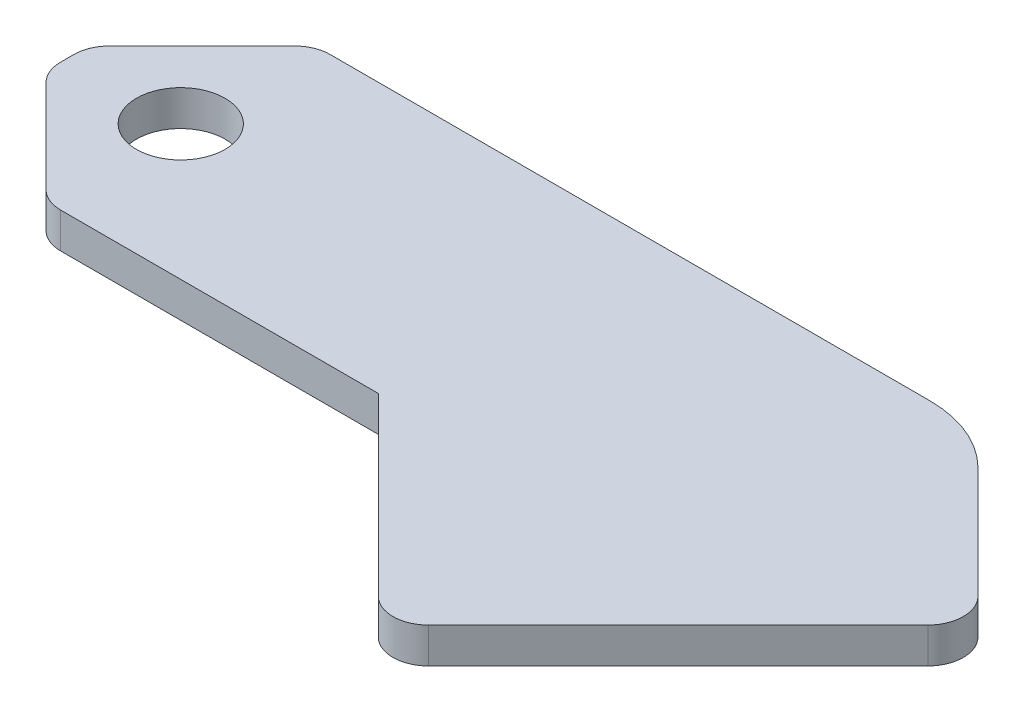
from build123d import *

# Parameters (mm, degrees)
ESQUISSE1_R        = 6.25
BOSS_EXTRU_1_DEPTH = 5


with BuildPart() as part:
    # Esquisse1 → Boss.-Extru.1 (new body)
    with BuildSketch(Plane(origin=(0, 2.5, 0), x_dir=(1, 0, 0), z_dir=(0, 1, 0))):
        with BuildLine():
            Line((-14.535533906, -4.464466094), (-1.464466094, -17.535533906))
            ThreePointArc((-1.464466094, -17.535533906), (0.15765065, -18.619397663), (2.071067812, -19))
            Line((2.071067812, -19), (46.852813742, -19))
            Line((46.852813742, -19), (71.601551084, -43.748737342))
            ThreePointArc((71.601551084, -43.748737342), (75.13708499, -45.213203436), (78.672618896, -43.748737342))
            Line((78.672618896, -43.748737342), (113.886536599, -8.534819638))
            ThreePointArc((113.886536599, -8.534819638), (115.351002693, -4.999285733), (113.886536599, -1.463751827))
            Line((113.886536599, -1.463751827), (98.214517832, 14.20826694))
            ThreePointArc((98.214517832, 14.20826694), (92.906951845, 17.754669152), (86.646250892, 19))
            Line((86.646250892, 19), (2.071067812, 19))
            ThreePointArc((2.071067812, 19), (0.15765065, 18.619397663), (-1.464466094, 17.535533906))
            Line((-1.464466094, 17.535533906), (-14.535533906, 4.464466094))
            ThreePointArc((-14.535533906, 4.464466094), (-15.619397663, 2.84234935), (-16, 0.928932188))
            Line((-16, 0.928932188), (-16, -0.928932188))
            ThreePointArc((-16, -0.928932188), (-15.619397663, -2.84234935), (-14.535533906, -4.464466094))
        make_face()
        with Locations(Location((0, 0, 0), (0, 0, 90))):
            Circle(ESQUISSE1_R, mode=Mode.SUBTRACT)
    extrude(amount=-BOSS_EXTRU_1_DEPTH)


solid = part.part
